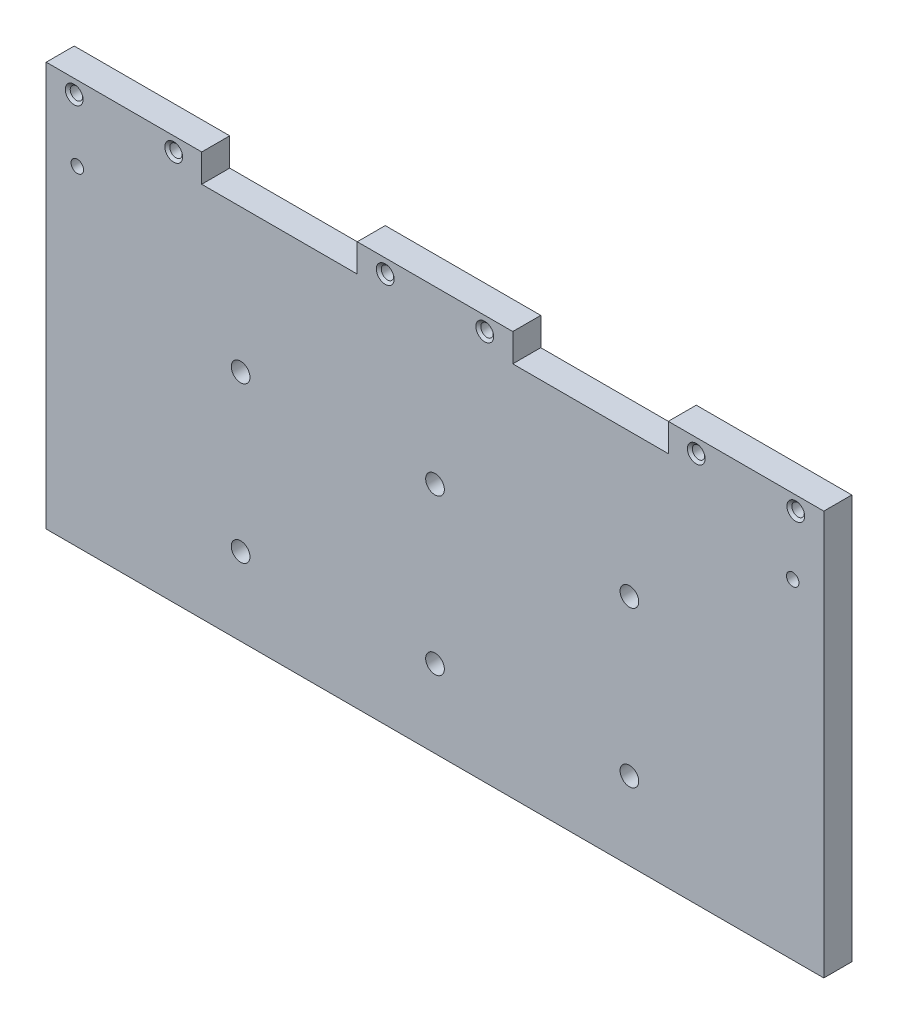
ISO-10303-21;
HEADER;
FILE_DESCRIPTION(('STEP AP214'),'2;1');
FILE_NAME('part.step','',(''),(''),'','','');
FILE_SCHEMA(('AUTOMOTIVE_DESIGN { 1 0 10303 214 1 1 1 1 }'));
ENDSEC;
DATA;
#1=APPLICATION_CONTEXT('core data for automotive mechanical design processes');
#2=APPLICATION_PROTOCOL_DEFINITION('international standard','automotive_design',2000,#1);
#3=PRODUCT_CONTEXT('',#1,'mechanical');
#4=PRODUCT('Part','Part','',(#3));
#5=PRODUCT_RELATED_PRODUCT_CATEGORY('part','',(#4));
#6=PRODUCT_DEFINITION_FORMATION('','',#4);
#7=PRODUCT_DEFINITION_CONTEXT('part definition',#1,'design');
#8=PRODUCT_DEFINITION('design','',#6,#7);
#9=PRODUCT_DEFINITION_SHAPE('','',#8);
#10=(LENGTH_UNIT() NAMED_UNIT(*) SI_UNIT(.MILLI.,.METRE.));
#11=(NAMED_UNIT(*) PLANE_ANGLE_UNIT() SI_UNIT($,.RADIAN.));
#12=(NAMED_UNIT(*) SI_UNIT($,.STERADIAN.) SOLID_ANGLE_UNIT());
#13=UNCERTAINTY_MEASURE_WITH_UNIT(LENGTH_MEASURE(1.E-05),#10,'distance_accuracy_value','');
#14=(GEOMETRIC_REPRESENTATION_CONTEXT(3) GLOBAL_UNCERTAINTY_ASSIGNED_CONTEXT((#13)) GLOBAL_UNIT_ASSIGNED_CONTEXT((#10,
#11,#12)) REPRESENTATION_CONTEXT('',''));
#15=CARTESIAN_POINT('',(0.,0.,0.));
#16=DIRECTION('',(0.,0.,1.));
#17=DIRECTION('',(1.,0.,0.));
#18=AXIS2_PLACEMENT_3D('',#15,#16,#17);
#19=CARTESIAN_POINT('',(-49.0030507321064,68.9522655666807,9.));
#20=DIRECTION('',(1.,0.,0.));
#21=DIRECTION('',(0.,1.,0.));
#22=AXIS2_PLACEMENT_3D('',#19,#20,#21);
#23=PLANE('',#22);
#24=DIRECTION('',(0.,-1.,0.));
#25=VECTOR('',#24,1.);
#26=CARTESIAN_POINT('',(-49.0030507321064,68.9522655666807,0.));
#27=LINE('',#26,#25);
#28=CARTESIAN_POINT('',(-49.0030507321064,68.9522655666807,0.));
#29=VERTEX_POINT('',#28);
#30=CARTESIAN_POINT('',(-49.0030507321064,-61.0477344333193,0.));
#31=VERTEX_POINT('',#30);
#32=EDGE_CURVE('E157',#29,#31,#27,.T.);
#33=ORIENTED_EDGE('',*,*,#32,.T.);
#34=DIRECTION('',(0.,0.,-1.));
#35=VECTOR('',#34,1.);
#36=CARTESIAN_POINT('',(-49.0030507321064,-61.0477344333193,9.));
#37=LINE('',#36,#35);
#38=CARTESIAN_POINT('',(-49.0030507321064,-61.0477344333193,9.));
#39=VERTEX_POINT('',#38);
#40=EDGE_CURVE('E11',#39,#31,#37,.T.);
#41=ORIENTED_EDGE('',*,*,#40,.F.);
#42=DIRECTION('',(0.,-1.,0.));
#43=VECTOR('',#42,1.);
#44=CARTESIAN_POINT('',(-49.0030507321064,68.9522655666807,9.));
#45=LINE('',#44,#43);
#46=CARTESIAN_POINT('',(-49.0030507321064,68.9522655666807,9.));
#47=VERTEX_POINT('',#46);
#48=EDGE_CURVE('E180',#47,#39,#45,.T.);
#49=ORIENTED_EDGE('',*,*,#48,.F.);
#50=DIRECTION('',(0.,0.,-1.));
#51=VECTOR('',#50,1.);
#52=CARTESIAN_POINT('',(-49.0030507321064,68.9522655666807,9.));
#53=LINE('',#52,#51);
#54=EDGE_CURVE('E153',#47,#29,#53,.T.);
#55=ORIENTED_EDGE('',*,*,#54,.T.);
#56=EDGE_LOOP('',(#33,#41,#49,#55));
#57=FACE_BOUND('',#56,.T.);
#58=ADVANCED_FACE('F35',(#57),#23,.F.);
#59=CARTESIAN_POINT('',(-49.0030507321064,-61.0477344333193,9.));
#60=DIRECTION('',(0.,1.,0.));
#61=DIRECTION('',(0.,0.,1.));
#62=AXIS2_PLACEMENT_3D('',#59,#60,#61);
#63=PLANE('',#62);
#64=DIRECTION('',(1.,0.,0.));
#65=VECTOR('',#64,1.);
#66=CARTESIAN_POINT('',(-49.0030507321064,-61.0477344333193,0.));
#67=LINE('',#66,#65);
#68=CARTESIAN_POINT('',(200.996949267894,-61.0477344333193,0.));
#69=VERTEX_POINT('',#68);
#70=EDGE_CURVE('E160',#31,#69,#67,.T.);
#71=ORIENTED_EDGE('',*,*,#70,.T.);
#72=DIRECTION('',(0.,0.,-1.));
#73=VECTOR('',#72,1.);
#74=CARTESIAN_POINT('',(200.996949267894,-61.0477344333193,9.));
#75=LINE('',#74,#73);
#76=CARTESIAN_POINT('',(200.996949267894,-61.0477344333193,9.));
#77=VERTEX_POINT('',#76);
#78=EDGE_CURVE('E44',#77,#69,#75,.T.);
#79=ORIENTED_EDGE('',*,*,#78,.F.);
#80=DIRECTION('',(1.,0.,0.));
#81=VECTOR('',#80,1.);
#82=CARTESIAN_POINT('',(-49.0030507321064,-61.0477344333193,9.));
#83=LINE('',#82,#81);
#84=EDGE_CURVE('E108',#39,#77,#83,.T.);
#85=ORIENTED_EDGE('',*,*,#84,.F.);
#86=ORIENTED_EDGE('',*,*,#40,.T.);
#87=EDGE_LOOP('',(#71,#79,#85,#86));
#88=FACE_BOUND('',#87,.T.);
#89=ADVANCED_FACE('F301',(#88),#63,.F.);
#90=CARTESIAN_POINT('',(200.996949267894,68.9522655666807,9.));
#91=DIRECTION('',(-1.,0.,0.));
#92=DIRECTION('',(0.,-1.,0.));
#93=AXIS2_PLACEMENT_3D('',#90,#91,#92);
#94=PLANE('',#93);
#95=DIRECTION('',(0.,1.,0.));
#96=VECTOR('',#95,1.);
#97=CARTESIAN_POINT('',(200.996949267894,68.9522655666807,0.));
#98=LINE('',#97,#96);
#99=CARTESIAN_POINT('',(200.996949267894,68.9522655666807,0.));
#100=VERTEX_POINT('',#99);
#101=EDGE_CURVE('E163',#69,#100,#98,.T.);
#102=ORIENTED_EDGE('',*,*,#101,.T.);
#103=DIRECTION('',(0.,0.,-1.));
#104=VECTOR('',#103,1.);
#105=CARTESIAN_POINT('',(200.996949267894,68.9522655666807,9.));
#106=LINE('',#105,#104);
#107=CARTESIAN_POINT('',(200.996949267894,68.9522655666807,9.));
#108=VERTEX_POINT('',#107);
#109=EDGE_CURVE('E199',#108,#100,#106,.T.);
#110=ORIENTED_EDGE('',*,*,#109,.F.);
#111=DIRECTION('',(0.,1.,0.));
#112=VECTOR('',#111,1.);
#113=CARTESIAN_POINT('',(200.996949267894,68.9522655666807,9.));
#114=LINE('',#113,#112);
#115=EDGE_CURVE('E260',#77,#108,#114,.T.);
#116=ORIENTED_EDGE('',*,*,#115,.F.);
#117=ORIENTED_EDGE('',*,*,#78,.T.);
#118=EDGE_LOOP('',(#102,#110,#116,#117));
#119=FACE_BOUND('',#118,.T.);
#120=ADVANCED_FACE('F305',(#119),#94,.F.);
#121=CARTESIAN_POINT('',(150.996949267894,68.9522655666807,9.));
#122=DIRECTION('',(0.,-1.,0.));
#123=DIRECTION('',(0.,0.,-1.));
#124=AXIS2_PLACEMENT_3D('',#121,#122,#123);
#125=PLANE('',#124);
#126=DIRECTION('',(-1.,0.,0.));
#127=VECTOR('',#126,1.);
#128=CARTESIAN_POINT('',(150.996949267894,68.9522655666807,0.));
#129=LINE('',#128,#127);
#130=CARTESIAN_POINT('',(150.996949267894,68.9522655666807,0.));
#131=VERTEX_POINT('',#130);
#132=EDGE_CURVE('E165',#100,#131,#129,.T.);
#133=ORIENTED_EDGE('',*,*,#132,.T.);
#134=DIRECTION('',(0.,0.,-1.));
#135=VECTOR('',#134,1.);
#136=CARTESIAN_POINT('',(150.996949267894,68.9522655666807,9.));
#137=LINE('',#136,#135);
#138=CARTESIAN_POINT('',(150.996949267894,68.9522655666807,9.));
#139=VERTEX_POINT('',#138);
#140=EDGE_CURVE('E196',#139,#131,#137,.T.);
#141=ORIENTED_EDGE('',*,*,#140,.F.);
#142=DIRECTION('',(-1.,0.,0.));
#143=VECTOR('',#142,1.);
#144=CARTESIAN_POINT('',(150.996949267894,68.9522655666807,9.));
#145=LINE('',#144,#143);
#146=EDGE_CURVE('E262',#108,#139,#145,.T.);
#147=ORIENTED_EDGE('',*,*,#146,.F.);
#148=ORIENTED_EDGE('',*,*,#109,.T.);
#149=EDGE_LOOP('',(#133,#141,#147,#148));
#150=FACE_BOUND('',#149,.T.);
#151=ADVANCED_FACE('F309',(#150),#125,.F.);
#152=CARTESIAN_POINT('',(150.996949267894,59.9522655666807,9.));
#153=DIRECTION('',(1.,0.,0.));
#154=DIRECTION('',(0.,0.,-1.));
#155=AXIS2_PLACEMENT_3D('',#152,#153,#154);
#156=PLANE('',#155);
#157=DIRECTION('',(0.,-1.,0.));
#158=VECTOR('',#157,1.);
#159=CARTESIAN_POINT('',(150.996949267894,59.9522655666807,0.));
#160=LINE('',#159,#158);
#161=CARTESIAN_POINT('',(150.996949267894,59.9522655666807,0.));
#162=VERTEX_POINT('',#161);
#163=EDGE_CURVE('E167',#131,#162,#160,.T.);
#164=ORIENTED_EDGE('',*,*,#163,.T.);
#165=DIRECTION('',(0.,0.,-1.));
#166=VECTOR('',#165,1.);
#167=CARTESIAN_POINT('',(150.996949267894,59.9522655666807,9.));
#168=LINE('',#167,#166);
#169=CARTESIAN_POINT('',(150.996949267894,59.9522655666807,9.));
#170=VERTEX_POINT('',#169);
#171=EDGE_CURVE('E193',#170,#162,#168,.T.);
#172=ORIENTED_EDGE('',*,*,#171,.F.);
#173=DIRECTION('',(0.,-1.,0.));
#174=VECTOR('',#173,1.);
#175=CARTESIAN_POINT('',(150.996949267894,59.9522655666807,9.));
#176=LINE('',#175,#174);
#177=EDGE_CURVE('E264',#139,#170,#176,.T.);
#178=ORIENTED_EDGE('',*,*,#177,.F.);
#179=ORIENTED_EDGE('',*,*,#140,.T.);
#180=EDGE_LOOP('',(#164,#172,#178,#179));
#181=FACE_BOUND('',#180,.T.);
#182=ADVANCED_FACE('F315',(#181),#156,.F.);
#183=CARTESIAN_POINT('',(100.996949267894,59.9522655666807,9.));
#184=DIRECTION('',(0.,-1.,0.));
#185=DIRECTION('',(0.,0.,-1.));
#186=AXIS2_PLACEMENT_3D('',#183,#184,#185);
#187=PLANE('',#186);
#188=DIRECTION('',(-1.,0.,0.));
#189=VECTOR('',#188,1.);
#190=CARTESIAN_POINT('',(100.996949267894,59.9522655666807,0.));
#191=LINE('',#190,#189);
#192=CARTESIAN_POINT('',(100.996949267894,59.9522655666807,0.));
#193=VERTEX_POINT('',#192);
#194=EDGE_CURVE('E169',#162,#193,#191,.T.);
#195=ORIENTED_EDGE('',*,*,#194,.T.);
#196=DIRECTION('',(0.,0.,-1.));
#197=VECTOR('',#196,1.);
#198=CARTESIAN_POINT('',(100.996949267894,59.9522655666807,9.));
#199=LINE('',#198,#197);
#200=CARTESIAN_POINT('',(100.996949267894,59.9522655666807,9.));
#201=VERTEX_POINT('',#200);
#202=EDGE_CURVE('E190',#201,#193,#199,.T.);
#203=ORIENTED_EDGE('',*,*,#202,.F.);
#204=DIRECTION('',(-1.,0.,0.));
#205=VECTOR('',#204,1.);
#206=CARTESIAN_POINT('',(100.996949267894,59.9522655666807,9.));
#207=LINE('',#206,#205);
#208=EDGE_CURVE('E266',#170,#201,#207,.T.);
#209=ORIENTED_EDGE('',*,*,#208,.F.);
#210=ORIENTED_EDGE('',*,*,#171,.T.);
#211=EDGE_LOOP('',(#195,#203,#209,#210));
#212=FACE_BOUND('',#211,.T.);
#213=ADVANCED_FACE('F319',(#212),#187,.F.);
#214=CARTESIAN_POINT('',(100.996949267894,68.9522655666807,9.));
#215=DIRECTION('',(-1.,0.,0.));
#216=DIRECTION('',(0.,0.,1.));
#217=AXIS2_PLACEMENT_3D('',#214,#215,#216);
#218=PLANE('',#217);
#219=DIRECTION('',(0.,1.,0.));
#220=VECTOR('',#219,1.);
#221=CARTESIAN_POINT('',(100.996949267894,68.9522655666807,0.));
#222=LINE('',#221,#220);
#223=CARTESIAN_POINT('',(100.996949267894,68.9522655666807,0.));
#224=VERTEX_POINT('',#223);
#225=EDGE_CURVE('E171',#193,#224,#222,.T.);
#226=ORIENTED_EDGE('',*,*,#225,.T.);
#227=DIRECTION('',(0.,0.,-1.));
#228=VECTOR('',#227,1.);
#229=CARTESIAN_POINT('',(100.996949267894,68.9522655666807,9.));
#230=LINE('',#229,#228);
#231=CARTESIAN_POINT('',(100.996949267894,68.9522655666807,9.));
#232=VERTEX_POINT('',#231);
#233=EDGE_CURVE('E187',#232,#224,#230,.T.);
#234=ORIENTED_EDGE('',*,*,#233,.F.);
#235=DIRECTION('',(0.,1.,0.));
#236=VECTOR('',#235,1.);
#237=CARTESIAN_POINT('',(100.996949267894,68.9522655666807,9.));
#238=LINE('',#237,#236);
#239=EDGE_CURVE('E268',#201,#232,#238,.T.);
#240=ORIENTED_EDGE('',*,*,#239,.F.);
#241=ORIENTED_EDGE('',*,*,#202,.T.);
#242=EDGE_LOOP('',(#226,#234,#240,#241));
#243=FACE_BOUND('',#242,.T.);
#244=ADVANCED_FACE('F323',(#243),#218,.F.);
#245=CARTESIAN_POINT('',(50.9969492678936,68.9522655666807,9.));
#246=DIRECTION('',(0.,-1.,0.));
#247=DIRECTION('',(0.,0.,-1.));
#248=AXIS2_PLACEMENT_3D('',#245,#246,#247);
#249=PLANE('',#248);
#250=DIRECTION('',(-1.,0.,0.));
#251=VECTOR('',#250,1.);
#252=CARTESIAN_POINT('',(50.9969492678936,68.9522655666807,0.));
#253=LINE('',#252,#251);
#254=CARTESIAN_POINT('',(50.9969492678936,68.9522655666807,0.));
#255=VERTEX_POINT('',#254);
#256=EDGE_CURVE('E173',#224,#255,#253,.T.);
#257=ORIENTED_EDGE('',*,*,#256,.T.);
#258=DIRECTION('',(0.,0.,-1.));
#259=VECTOR('',#258,1.);
#260=CARTESIAN_POINT('',(50.9969492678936,68.9522655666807,9.));
#261=LINE('',#260,#259);
#262=CARTESIAN_POINT('',(50.9969492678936,68.9522655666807,9.));
#263=VERTEX_POINT('',#262);
#264=EDGE_CURVE('E184',#263,#255,#261,.T.);
#265=ORIENTED_EDGE('',*,*,#264,.F.);
#266=DIRECTION('',(-1.,0.,0.));
#267=VECTOR('',#266,1.);
#268=CARTESIAN_POINT('',(50.9969492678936,68.9522655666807,9.));
#269=LINE('',#268,#267);
#270=EDGE_CURVE('E270',#232,#263,#269,.T.);
#271=ORIENTED_EDGE('',*,*,#270,.F.);
#272=ORIENTED_EDGE('',*,*,#233,.T.);
#273=EDGE_LOOP('',(#257,#265,#271,#272));
#274=FACE_BOUND('',#273,.T.);
#275=ADVANCED_FACE('F276',(#274),#249,.F.);
#276=CARTESIAN_POINT('',(50.9969492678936,59.9522655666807,9.));
#277=DIRECTION('',(1.,0.,0.));
#278=DIRECTION('',(0.,0.,-1.));
#279=AXIS2_PLACEMENT_3D('',#276,#277,#278);
#280=PLANE('',#279);
#281=DIRECTION('',(0.,-1.,0.));
#282=VECTOR('',#281,1.);
#283=CARTESIAN_POINT('',(50.9969492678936,59.9522655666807,0.));
#284=LINE('',#283,#282);
#285=CARTESIAN_POINT('',(50.9969492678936,59.9522655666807,0.));
#286=VERTEX_POINT('',#285);
#287=EDGE_CURVE('E175',#255,#286,#284,.T.);
#288=ORIENTED_EDGE('',*,*,#287,.T.);
#289=DIRECTION('',(0.,0.,-1.));
#290=VECTOR('',#289,1.);
#291=CARTESIAN_POINT('',(50.9969492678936,59.9522655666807,9.));
#292=LINE('',#291,#290);
#293=CARTESIAN_POINT('',(50.9969492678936,59.9522655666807,9.));
#294=VERTEX_POINT('',#293);
#295=EDGE_CURVE('E148',#294,#286,#292,.T.);
#296=ORIENTED_EDGE('',*,*,#295,.F.);
#297=DIRECTION('',(0.,-1.,0.));
#298=VECTOR('',#297,1.);
#299=CARTESIAN_POINT('',(50.9969492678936,59.9522655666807,9.));
#300=LINE('',#299,#298);
#301=EDGE_CURVE('E139',#263,#294,#300,.T.);
#302=ORIENTED_EDGE('',*,*,#301,.F.);
#303=ORIENTED_EDGE('',*,*,#264,.T.);
#304=EDGE_LOOP('',(#288,#296,#302,#303));
#305=FACE_BOUND('',#304,.T.);
#306=ADVANCED_FACE('F280',(#305),#280,.F.);
#307=CARTESIAN_POINT('',(0.996949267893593,59.9522655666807,9.));
#308=DIRECTION('',(0.,-1.,0.));
#309=DIRECTION('',(0.,0.,-1.));
#310=AXIS2_PLACEMENT_3D('',#307,#308,#309);
#311=PLANE('',#310);
#312=DIRECTION('',(-1.,0.,0.));
#313=VECTOR('',#312,1.);
#314=CARTESIAN_POINT('',(0.996949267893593,59.9522655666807,0.));
#315=LINE('',#314,#313);
#316=CARTESIAN_POINT('',(0.996949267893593,59.9522655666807,0.));
#317=VERTEX_POINT('',#316);
#318=EDGE_CURVE('E147',#286,#317,#315,.T.);
#319=ORIENTED_EDGE('',*,*,#318,.T.);
#320=DIRECTION('',(0.,0.,-1.));
#321=VECTOR('',#320,1.);
#322=CARTESIAN_POINT('',(0.996949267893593,59.9522655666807,9.));
#323=LINE('',#322,#321);
#324=CARTESIAN_POINT('',(0.996949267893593,59.9522655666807,9.));
#325=VERTEX_POINT('',#324);
#326=EDGE_CURVE('E144',#325,#317,#323,.T.);
#327=ORIENTED_EDGE('',*,*,#326,.F.);
#328=DIRECTION('',(-1.,0.,0.));
#329=VECTOR('',#328,1.);
#330=CARTESIAN_POINT('',(0.996949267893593,59.9522655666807,9.));
#331=LINE('',#330,#329);
#332=EDGE_CURVE('E133',#294,#325,#331,.T.);
#333=ORIENTED_EDGE('',*,*,#332,.F.);
#334=ORIENTED_EDGE('',*,*,#295,.T.);
#335=EDGE_LOOP('',(#319,#327,#333,#334));
#336=FACE_BOUND('',#335,.T.);
#337=ADVANCED_FACE('F145',(#336),#311,.F.);
#338=CARTESIAN_POINT('',(0.996949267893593,68.9522655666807,9.));
#339=DIRECTION('',(-1.,0.,0.));
#340=DIRECTION('',(0.,0.,1.));
#341=AXIS2_PLACEMENT_3D('',#338,#339,#340);
#342=PLANE('',#341);
#343=DIRECTION('',(0.,1.,0.));
#344=VECTOR('',#343,1.);
#345=CARTESIAN_POINT('',(0.996949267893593,68.9522655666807,0.));
#346=LINE('',#345,#344);
#347=CARTESIAN_POINT('',(0.996949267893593,68.9522655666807,0.));
#348=VERTEX_POINT('',#347);
#349=EDGE_CURVE('E94',#317,#348,#346,.T.);
#350=ORIENTED_EDGE('',*,*,#349,.T.);
#351=DIRECTION('',(0.,0.,-1.));
#352=VECTOR('',#351,1.);
#353=CARTESIAN_POINT('',(0.996949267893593,68.9522655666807,9.));
#354=LINE('',#353,#352);
#355=CARTESIAN_POINT('',(0.996949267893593,68.9522655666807,9.));
#356=VERTEX_POINT('',#355);
#357=EDGE_CURVE('E149',#356,#348,#354,.T.);
#358=ORIENTED_EDGE('',*,*,#357,.F.);
#359=DIRECTION('',(0.,1.,0.));
#360=VECTOR('',#359,1.);
#361=CARTESIAN_POINT('',(0.996949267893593,68.9522655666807,9.));
#362=LINE('',#361,#360);
#363=EDGE_CURVE('E137',#325,#356,#362,.T.);
#364=ORIENTED_EDGE('',*,*,#363,.F.);
#365=ORIENTED_EDGE('',*,*,#326,.T.);
#366=EDGE_LOOP('',(#350,#358,#364,#365));
#367=FACE_BOUND('',#366,.T.);
#368=ADVANCED_FACE('F151',(#367),#342,.F.);
#369=CARTESIAN_POINT('',(-49.0030507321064,68.9522655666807,9.));
#370=DIRECTION('',(0.,-1.,0.));
#371=DIRECTION('',(0.,0.,-1.));
#372=AXIS2_PLACEMENT_3D('',#369,#370,#371);
#373=PLANE('',#372);
#374=DIRECTION('',(-1.,0.,0.));
#375=VECTOR('',#374,1.);
#376=CARTESIAN_POINT('',(-49.0030507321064,68.9522655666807,0.));
#377=LINE('',#376,#375);
#378=EDGE_CURVE('E100',#348,#29,#377,.T.);
#379=ORIENTED_EDGE('',*,*,#378,.T.);
#380=ORIENTED_EDGE('',*,*,#54,.F.);
#381=DIRECTION('',(-1.,0.,0.));
#382=VECTOR('',#381,1.);
#383=CARTESIAN_POINT('',(-49.0030507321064,68.9522655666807,9.));
#384=LINE('',#383,#382);
#385=EDGE_CURVE('E53',#356,#47,#384,.T.);
#386=ORIENTED_EDGE('',*,*,#385,.F.);
#387=ORIENTED_EDGE('',*,*,#357,.T.);
#388=EDGE_LOOP('',(#379,#380,#386,#387));
#389=FACE_BOUND('',#388,.T.);
#390=ADVANCED_FACE('F288',(#389),#373,.F.);
#391=CARTESIAN_POINT('',(0.,0.,9.));
#392=DIRECTION('',(0.,0.,1.));
#393=DIRECTION('',(1.,0.,0.));
#394=AXIS2_PLACEMENT_3D('',#391,#392,#393);
#395=PLANE('',#394);
#396=CARTESIAN_POINT('',(75.9969492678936,-36.0477344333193,9.));
#397=DIRECTION('',(0.,0.,1.));
#398=DIRECTION('',(1.,0.,0.));
#399=AXIS2_PLACEMENT_3D('',#396,#397,#398);
#400=CIRCLE('',#399,3.00000000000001);
#401=CARTESIAN_POINT('',(78.9969492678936,-36.0477344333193,9.));
#402=VERTEX_POINT('',#401);
#403=EDGE_CURVE('E559',#402,#402,#400,.T.);
#404=ORIENTED_EDGE('',*,*,#403,.F.);
#405=EDGE_LOOP('',(#404));
#406=FACE_BOUND('',#405,.T.);
#407=CARTESIAN_POINT('',(75.9969492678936,13.9522655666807,9.));
#408=DIRECTION('',(0.,0.,1.));
#409=DIRECTION('',(1.,0.,0.));
#410=AXIS2_PLACEMENT_3D('',#407,#408,#409);
#411=CIRCLE('',#410,3.00000000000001);
#412=CARTESIAN_POINT('',(78.9969492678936,13.9522655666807,9.));
#413=VERTEX_POINT('',#412);
#414=EDGE_CURVE('E585',#413,#413,#411,.T.);
#415=ORIENTED_EDGE('',*,*,#414,.F.);
#416=EDGE_LOOP('',(#415));
#417=FACE_BOUND('',#416,.T.);
#418=CARTESIAN_POINT('',(13.4969492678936,-36.0477344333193,9.));
#419=DIRECTION('',(0.,0.,1.));
#420=DIRECTION('',(1.,0.,0.));
#421=AXIS2_PLACEMENT_3D('',#418,#419,#420);
#422=CIRCLE('',#421,2.99999999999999);
#423=CARTESIAN_POINT('',(16.4969492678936,-36.0477344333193,9.));
#424=VERTEX_POINT('',#423);
#425=EDGE_CURVE('E582',#424,#424,#422,.T.);
#426=ORIENTED_EDGE('',*,*,#425,.F.);
#427=EDGE_LOOP('',(#426));
#428=FACE_BOUND('',#427,.T.);
#429=CARTESIAN_POINT('',(13.4969492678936,13.9522655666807,9.));
#430=DIRECTION('',(0.,0.,1.));
#431=DIRECTION('',(1.,0.,0.));
#432=AXIS2_PLACEMENT_3D('',#429,#430,#431);
#433=CIRCLE('',#432,2.99999999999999);
#434=CARTESIAN_POINT('',(16.4969492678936,13.9522655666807,9.));
#435=VERTEX_POINT('',#434);
#436=EDGE_CURVE('E579',#435,#435,#433,.T.);
#437=ORIENTED_EDGE('',*,*,#436,.F.);
#438=EDGE_LOOP('',(#437));
#439=FACE_BOUND('',#438,.T.);
#440=CARTESIAN_POINT('',(138.496949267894,-36.0477344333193,9.));
#441=DIRECTION('',(0.,0.,1.));
#442=DIRECTION('',(1.,0.,0.));
#443=AXIS2_PLACEMENT_3D('',#440,#441,#442);
#444=CIRCLE('',#443,2.99999999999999);
#445=CARTESIAN_POINT('',(141.496949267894,-36.0477344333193,9.));
#446=VERTEX_POINT('',#445);
#447=EDGE_CURVE('E575',#446,#446,#444,.T.);
#448=ORIENTED_EDGE('',*,*,#447,.F.);
#449=EDGE_LOOP('',(#448));
#450=FACE_BOUND('',#449,.T.);
#451=CARTESIAN_POINT('',(138.496949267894,13.9522655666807,9.));
#452=DIRECTION('',(0.,0.,1.));
#453=DIRECTION('',(1.,0.,0.));
#454=AXIS2_PLACEMENT_3D('',#451,#452,#453);
#455=CIRCLE('',#454,2.99999999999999);
#456=CARTESIAN_POINT('',(141.496949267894,13.9522655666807,9.));
#457=VERTEX_POINT('',#456);
#458=EDGE_CURVE('E592',#457,#457,#455,.T.);
#459=ORIENTED_EDGE('',*,*,#458,.F.);
#460=EDGE_LOOP('',(#459));
#461=FACE_BOUND('',#460,.T.);
#462=CARTESIAN_POINT('',(-39.0030507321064,44.9522655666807,9.));
#463=DIRECTION('',(0.,0.,1.));
#464=DIRECTION('',(1.,0.,0.));
#465=AXIS2_PLACEMENT_3D('',#462,#463,#464);
#466=CIRCLE('',#465,2.);
#467=CARTESIAN_POINT('',(-37.0030507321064,44.9522655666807,9.));
#468=VERTEX_POINT('',#467);
#469=EDGE_CURVE('E598',#468,#468,#466,.T.);
#470=ORIENTED_EDGE('',*,*,#469,.F.);
#471=EDGE_LOOP('',(#470));
#472=FACE_BOUND('',#471,.T.);
#473=CARTESIAN_POINT('',(190.996949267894,44.9522655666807,9.));
#474=DIRECTION('',(0.,0.,1.));
#475=DIRECTION('',(1.,0.,0.));
#476=AXIS2_PLACEMENT_3D('',#473,#474,#475);
#477=CIRCLE('',#476,1.99999999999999);
#478=CARTESIAN_POINT('',(192.996949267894,44.9522655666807,9.));
#479=VERTEX_POINT('',#478);
#480=EDGE_CURVE('E603',#479,#479,#477,.T.);
#481=ORIENTED_EDGE('',*,*,#480,.F.);
#482=EDGE_LOOP('',(#481));
#483=FACE_BOUND('',#482,.T.);
#484=CARTESIAN_POINT('',(-40.0030507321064,64.4522655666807,9.));
#485=DIRECTION('',(0.,0.,1.));
#486=DIRECTION('',(1.,0.,0.));
#487=AXIS2_PLACEMENT_3D('',#484,#485,#486);
#488=CIRCLE('',#487,2.8575);
#489=CARTESIAN_POINT('',(-37.1455507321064,64.4522655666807,9.));
#490=VERTEX_POINT('',#489);
#491=EDGE_CURVE('E232',#490,#490,#488,.T.);
#492=ORIENTED_EDGE('',*,*,#491,.F.);
#493=EDGE_LOOP('',(#492));
#494=FACE_BOUND('',#493,.T.);
#495=CARTESIAN_POINT('',(-8.00305073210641,64.4522655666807,9.));
#496=DIRECTION('',(0.,0.,1.));
#497=DIRECTION('',(1.,0.,0.));
#498=AXIS2_PLACEMENT_3D('',#495,#496,#497);
#499=CIRCLE('',#498,2.8575);
#500=CARTESIAN_POINT('',(-5.14555073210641,64.4522655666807,9.));
#501=VERTEX_POINT('',#500);
#502=EDGE_CURVE('E222',#501,#501,#499,.T.);
#503=ORIENTED_EDGE('',*,*,#502,.F.);
#504=EDGE_LOOP('',(#503));
#505=FACE_BOUND('',#504,.T.);
#506=CARTESIAN_POINT('',(59.9969492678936,64.4522655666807,9.));
#507=DIRECTION('',(0.,0.,1.));
#508=DIRECTION('',(1.,0.,0.));
#509=AXIS2_PLACEMENT_3D('',#506,#507,#508);
#510=CIRCLE('',#509,2.8575);
#511=CARTESIAN_POINT('',(62.8544492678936,64.4522655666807,9.));
#512=VERTEX_POINT('',#511);
#513=EDGE_CURVE('E219',#512,#512,#510,.T.);
#514=ORIENTED_EDGE('',*,*,#513,.F.);
#515=EDGE_LOOP('',(#514));
#516=FACE_BOUND('',#515,.T.);
#517=CARTESIAN_POINT('',(91.9969492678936,64.4522655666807,9.));
#518=DIRECTION('',(0.,0.,1.));
#519=DIRECTION('',(1.,0.,0.));
#520=AXIS2_PLACEMENT_3D('',#517,#518,#519);
#521=CIRCLE('',#520,2.8575);
#522=CARTESIAN_POINT('',(94.8544492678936,64.4522655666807,9.));
#523=VERTEX_POINT('',#522);
#524=EDGE_CURVE('E216',#523,#523,#521,.T.);
#525=ORIENTED_EDGE('',*,*,#524,.F.);
#526=EDGE_LOOP('',(#525));
#527=FACE_BOUND('',#526,.T.);
#528=CARTESIAN_POINT('',(191.996949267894,64.4522655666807,9.));
#529=DIRECTION('',(0.,0.,1.));
#530=DIRECTION('',(1.,0.,0.));
#531=AXIS2_PLACEMENT_3D('',#528,#529,#530);
#532=CIRCLE('',#531,2.85750000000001);
#533=CARTESIAN_POINT('',(194.854449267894,64.4522655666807,9.));
#534=VERTEX_POINT('',#533);
#535=EDGE_CURVE('E212',#534,#534,#532,.T.);
#536=ORIENTED_EDGE('',*,*,#535,.F.);
#537=EDGE_LOOP('',(#536));
#538=FACE_BOUND('',#537,.T.);
#539=CARTESIAN_POINT('',(159.996949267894,64.4522655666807,9.));
#540=DIRECTION('',(0.,0.,1.));
#541=DIRECTION('',(1.,0.,0.));
#542=AXIS2_PLACEMENT_3D('',#539,#540,#541);
#543=CIRCLE('',#542,2.85749999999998);
#544=CARTESIAN_POINT('',(162.854449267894,64.4522655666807,9.));
#545=VERTEX_POINT('',#544);
#546=EDGE_CURVE('E208',#545,#545,#543,.T.);
#547=ORIENTED_EDGE('',*,*,#546,.F.);
#548=EDGE_LOOP('',(#547));
#549=FACE_BOUND('',#548,.T.);
#550=ORIENTED_EDGE('',*,*,#48,.T.);
#551=ORIENTED_EDGE('',*,*,#84,.T.);
#552=ORIENTED_EDGE('',*,*,#115,.T.);
#553=ORIENTED_EDGE('',*,*,#146,.T.);
#554=ORIENTED_EDGE('',*,*,#177,.T.);
#555=ORIENTED_EDGE('',*,*,#208,.T.);
#556=ORIENTED_EDGE('',*,*,#239,.T.);
#557=ORIENTED_EDGE('',*,*,#270,.T.);
#558=ORIENTED_EDGE('',*,*,#301,.T.);
#559=ORIENTED_EDGE('',*,*,#332,.T.);
#560=ORIENTED_EDGE('',*,*,#363,.T.);
#561=ORIENTED_EDGE('',*,*,#385,.T.);
#562=EDGE_LOOP('',(#550,#551,#552,#553,#554,#555,#556,#557,#558,#559,#560,#561));
#563=FACE_BOUND('',#562,.T.);
#564=ADVANCED_FACE('F135',(#406,#417,#428,#439,#450,#461,#472,#483,#494,#505,#516,#527,#538,
#549,#563),#395,.T.);
#565=CARTESIAN_POINT('',(0.,0.,0.));
#566=DIRECTION('',(0.,0.,1.));
#567=DIRECTION('',(1.,0.,0.));
#568=AXIS2_PLACEMENT_3D('',#565,#566,#567);
#569=PLANE('',#568);
#570=CARTESIAN_POINT('',(75.9969492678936,-36.0477344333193,0.));
#571=DIRECTION('',(0.,0.,-1.));
#572=DIRECTION('',(-1.,0.,0.));
#573=AXIS2_PLACEMENT_3D('',#570,#571,#572);
#574=CIRCLE('',#573,3.00000000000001);
#575=CARTESIAN_POINT('',(72.9969492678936,-36.0477344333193,0.));
#576=VERTEX_POINT('',#575);
#577=EDGE_CURVE('E562',#576,#576,#574,.T.);
#578=ORIENTED_EDGE('',*,*,#577,.F.);
#579=EDGE_LOOP('',(#578));
#580=FACE_BOUND('',#579,.T.);
#581=CARTESIAN_POINT('',(75.9969492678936,13.9522655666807,0.));
#582=DIRECTION('',(0.,0.,-1.));
#583=DIRECTION('',(-1.,0.,0.));
#584=AXIS2_PLACEMENT_3D('',#581,#582,#583);
#585=CIRCLE('',#584,3.00000000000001);
#586=CARTESIAN_POINT('',(72.9969492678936,13.9522655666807,0.));
#587=VERTEX_POINT('',#586);
#588=EDGE_CURVE('E564',#587,#587,#585,.T.);
#589=ORIENTED_EDGE('',*,*,#588,.F.);
#590=EDGE_LOOP('',(#589));
#591=FACE_BOUND('',#590,.T.);
#592=CARTESIAN_POINT('',(13.4969492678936,-36.0477344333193,0.));
#593=DIRECTION('',(0.,0.,-1.));
#594=DIRECTION('',(1.,0.,0.));
#595=AXIS2_PLACEMENT_3D('',#592,#593,#594);
#596=CIRCLE('',#595,2.99999999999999);
#597=CARTESIAN_POINT('',(16.4969492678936,-36.0477344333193,0.));
#598=VERTEX_POINT('',#597);
#599=EDGE_CURVE('E570',#598,#598,#596,.T.);
#600=ORIENTED_EDGE('',*,*,#599,.F.);
#601=EDGE_LOOP('',(#600));
#602=FACE_BOUND('',#601,.T.);
#603=CARTESIAN_POINT('',(13.4969492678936,13.9522655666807,0.));
#604=DIRECTION('',(0.,0.,-1.));
#605=DIRECTION('',(1.,0.,0.));
#606=AXIS2_PLACEMENT_3D('',#603,#604,#605);
#607=CIRCLE('',#606,2.99999999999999);
#608=CARTESIAN_POINT('',(16.4969492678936,13.9522655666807,0.));
#609=VERTEX_POINT('',#608);
#610=EDGE_CURVE('E563',#609,#609,#607,.T.);
#611=ORIENTED_EDGE('',*,*,#610,.F.);
#612=EDGE_LOOP('',(#611));
#613=FACE_BOUND('',#612,.T.);
#614=CARTESIAN_POINT('',(138.496949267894,-36.0477344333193,0.));
#615=DIRECTION('',(0.,0.,-1.));
#616=DIRECTION('',(-1.,0.,0.));
#617=AXIS2_PLACEMENT_3D('',#614,#615,#616);
#618=CIRCLE('',#617,2.99999999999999);
#619=CARTESIAN_POINT('',(135.496949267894,-36.0477344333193,0.));
#620=VERTEX_POINT('',#619);
#621=EDGE_CURVE('E567',#620,#620,#618,.T.);
#622=ORIENTED_EDGE('',*,*,#621,.F.);
#623=EDGE_LOOP('',(#622));
#624=FACE_BOUND('',#623,.T.);
#625=CARTESIAN_POINT('',(138.496949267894,13.9522655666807,0.));
#626=DIRECTION('',(0.,0.,-1.));
#627=DIRECTION('',(-1.,0.,0.));
#628=AXIS2_PLACEMENT_3D('',#625,#626,#627);
#629=CIRCLE('',#628,2.99999999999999);
#630=CARTESIAN_POINT('',(135.496949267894,13.9522655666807,0.));
#631=VERTEX_POINT('',#630);
#632=EDGE_CURVE('E589',#631,#631,#629,.T.);
#633=ORIENTED_EDGE('',*,*,#632,.F.);
#634=EDGE_LOOP('',(#633));
#635=FACE_BOUND('',#634,.T.);
#636=CARTESIAN_POINT('',(-39.0030507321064,44.9522655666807,0.));
#637=DIRECTION('',(0.,0.,-1.));
#638=DIRECTION('',(-1.,0.,0.));
#639=AXIS2_PLACEMENT_3D('',#636,#637,#638);
#640=CIRCLE('',#639,2.);
#641=CARTESIAN_POINT('',(-41.0030507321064,44.9522655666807,0.));
#642=VERTEX_POINT('',#641);
#643=EDGE_CURVE('E595',#642,#642,#640,.T.);
#644=ORIENTED_EDGE('',*,*,#643,.F.);
#645=EDGE_LOOP('',(#644));
#646=FACE_BOUND('',#645,.T.);
#647=CARTESIAN_POINT('',(190.996949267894,44.9522655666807,0.));
#648=DIRECTION('',(0.,0.,-1.));
#649=DIRECTION('',(-1.,0.,0.));
#650=AXIS2_PLACEMENT_3D('',#647,#648,#649);
#651=CIRCLE('',#650,1.99999999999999);
#652=CARTESIAN_POINT('',(188.996949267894,44.9522655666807,0.));
#653=VERTEX_POINT('',#652);
#654=EDGE_CURVE('E601',#653,#653,#651,.T.);
#655=ORIENTED_EDGE('',*,*,#654,.F.);
#656=EDGE_LOOP('',(#655));
#657=FACE_BOUND('',#656,.T.);
#658=CARTESIAN_POINT('',(-8.00305073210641,64.4522655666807,0.));
#659=DIRECTION('',(0.,0.,1.));
#660=DIRECTION('',(1.,0.,0.));
#661=AXIS2_PLACEMENT_3D('',#658,#659,#660);
#662=CIRCLE('',#661,2.);
#663=CARTESIAN_POINT('',(-6.00305073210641,64.4522655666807,0.));
#664=VERTEX_POINT('',#663);
#665=EDGE_CURVE('E242',#664,#664,#662,.T.);
#666=ORIENTED_EDGE('',*,*,#665,.T.);
#667=EDGE_LOOP('',(#666));
#668=FACE_BOUND('',#667,.T.);
#669=CARTESIAN_POINT('',(-40.0030507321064,64.4522655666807,0.));
#670=DIRECTION('',(0.,0.,1.));
#671=DIRECTION('',(1.,0.,0.));
#672=AXIS2_PLACEMENT_3D('',#669,#670,#671);
#673=CIRCLE('',#672,2.);
#674=CARTESIAN_POINT('',(-38.0030507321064,64.4522655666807,0.));
#675=VERTEX_POINT('',#674);
#676=EDGE_CURVE('E245',#675,#675,#673,.T.);
#677=ORIENTED_EDGE('',*,*,#676,.T.);
#678=EDGE_LOOP('',(#677));
#679=FACE_BOUND('',#678,.T.);
#680=CARTESIAN_POINT('',(91.9969492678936,64.4522655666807,0.));
#681=DIRECTION('',(0.,0.,1.));
#682=DIRECTION('',(-1.,0.,0.));
#683=AXIS2_PLACEMENT_3D('',#680,#681,#682);
#684=CIRCLE('',#683,2.00000000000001);
#685=CARTESIAN_POINT('',(89.9969492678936,64.4522655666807,0.));
#686=VERTEX_POINT('',#685);
#687=EDGE_CURVE('E248',#686,#686,#684,.T.);
#688=ORIENTED_EDGE('',*,*,#687,.T.);
#689=EDGE_LOOP('',(#688));
#690=FACE_BOUND('',#689,.T.);
#691=CARTESIAN_POINT('',(191.996949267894,64.4522655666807,0.));
#692=DIRECTION('',(0.,0.,1.));
#693=DIRECTION('',(-1.,0.,0.));
#694=AXIS2_PLACEMENT_3D('',#691,#692,#693);
#695=CIRCLE('',#694,2.);
#696=CARTESIAN_POINT('',(189.996949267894,64.4522655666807,0.));
#697=VERTEX_POINT('',#696);
#698=EDGE_CURVE('E251',#697,#697,#695,.T.);
#699=ORIENTED_EDGE('',*,*,#698,.T.);
#700=EDGE_LOOP('',(#699));
#701=FACE_BOUND('',#700,.T.);
#702=CARTESIAN_POINT('',(159.996949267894,64.4522655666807,0.));
#703=DIRECTION('',(0.,0.,1.));
#704=DIRECTION('',(-1.,0.,0.));
#705=AXIS2_PLACEMENT_3D('',#702,#703,#704);
#706=CIRCLE('',#705,2.00000000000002);
#707=CARTESIAN_POINT('',(157.996949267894,64.4522655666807,0.));
#708=VERTEX_POINT('',#707);
#709=EDGE_CURVE('E207',#708,#708,#706,.T.);
#710=ORIENTED_EDGE('',*,*,#709,.T.);
#711=EDGE_LOOP('',(#710));
#712=FACE_BOUND('',#711,.T.);
#713=CARTESIAN_POINT('',(59.9969492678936,64.4522655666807,0.));
#714=DIRECTION('',(0.,0.,1.));
#715=DIRECTION('',(1.,0.,0.));
#716=AXIS2_PLACEMENT_3D('',#713,#714,#715);
#717=CIRCLE('',#716,2.);
#718=CARTESIAN_POINT('',(61.9969492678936,64.4522655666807,0.));
#719=VERTEX_POINT('',#718);
#720=EDGE_CURVE('E161',#719,#719,#717,.T.);
#721=ORIENTED_EDGE('',*,*,#720,.T.);
#722=EDGE_LOOP('',(#721));
#723=FACE_BOUND('',#722,.T.);
#724=ORIENTED_EDGE('',*,*,#32,.F.);
#725=ORIENTED_EDGE('',*,*,#378,.F.);
#726=ORIENTED_EDGE('',*,*,#349,.F.);
#727=ORIENTED_EDGE('',*,*,#318,.F.);
#728=ORIENTED_EDGE('',*,*,#287,.F.);
#729=ORIENTED_EDGE('',*,*,#256,.F.);
#730=ORIENTED_EDGE('',*,*,#225,.F.);
#731=ORIENTED_EDGE('',*,*,#194,.F.);
#732=ORIENTED_EDGE('',*,*,#163,.F.);
#733=ORIENTED_EDGE('',*,*,#132,.F.);
#734=ORIENTED_EDGE('',*,*,#101,.F.);
#735=ORIENTED_EDGE('',*,*,#70,.F.);
#736=EDGE_LOOP('',(#724,#725,#726,#727,#728,#729,#730,#731,#732,#733,#734,#735));
#737=FACE_BOUND('',#736,.T.);
#738=ADVANCED_FACE('F283',(#580,#591,#602,#613,#624,#635,#646,#657,#668,#679,#690,#701,#712,
#723,#737),#569,.F.);
#739=CARTESIAN_POINT('',(59.9969492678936,64.4522655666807,0.));
#740=DIRECTION('',(0.,0.,1.));
#741=DIRECTION('',(1.,0.,0.));
#742=AXIS2_PLACEMENT_3D('',#739,#740,#741);
#743=CYLINDRICAL_SURFACE('',#742,2.);
#744=CARTESIAN_POINT('',(59.9969492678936,64.4522655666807,8.28047206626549));
#745=DIRECTION('',(0.,0.,1.));
#746=DIRECTION('',(1.,0.,0.));
#747=AXIS2_PLACEMENT_3D('',#744,#745,#746);
#748=CIRCLE('',#747,2.);
#749=CARTESIAN_POINT('',(61.9969492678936,64.4522655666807,8.28047206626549));
#750=VERTEX_POINT('',#749);
#751=EDGE_CURVE('E217',#750,#750,#748,.T.);
#752=ORIENTED_EDGE('',*,*,#751,.T.);
#753=EDGE_LOOP('',(#752));
#754=FACE_BOUND('',#753,.T.);
#755=ORIENTED_EDGE('',*,*,#720,.F.);
#756=EDGE_LOOP('',(#755));
#757=FACE_BOUND('',#756,.T.);
#758=ADVANCED_FACE('F351',(#754,#757),#743,.F.);
#759=CARTESIAN_POINT('',(159.996949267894,64.4522655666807,0.));
#760=DIRECTION('',(0.,0.,1.));
#761=DIRECTION('',(1.,0.,0.));
#762=AXIS2_PLACEMENT_3D('',#759,#760,#761);
#763=CYLINDRICAL_SURFACE('',#762,2.00000000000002);
#764=CARTESIAN_POINT('',(159.996949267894,64.4522655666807,8.2804720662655));
#765=DIRECTION('',(0.,0.,1.));
#766=DIRECTION('',(1.,0.,0.));
#767=AXIS2_PLACEMENT_3D('',#764,#765,#766);
#768=CIRCLE('',#767,2.00000000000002);
#769=CARTESIAN_POINT('',(161.996949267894,64.4522655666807,8.2804720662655));
#770=VERTEX_POINT('',#769);
#771=EDGE_CURVE('E204',#770,#770,#768,.T.);
#772=ORIENTED_EDGE('',*,*,#771,.T.);
#773=EDGE_LOOP('',(#772));
#774=FACE_BOUND('',#773,.T.);
#775=ORIENTED_EDGE('',*,*,#709,.F.);
#776=EDGE_LOOP('',(#775));
#777=FACE_BOUND('',#776,.T.);
#778=ADVANCED_FACE('F356',(#774,#777),#763,.F.);
#779=CARTESIAN_POINT('',(191.996949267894,64.4522655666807,0.));
#780=DIRECTION('',(0.,0.,1.));
#781=DIRECTION('',(1.,0.,0.));
#782=AXIS2_PLACEMENT_3D('',#779,#780,#781);
#783=CYLINDRICAL_SURFACE('',#782,2.);
#784=CARTESIAN_POINT('',(191.996949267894,64.4522655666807,8.28047206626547));
#785=DIRECTION('',(0.,0.,1.));
#786=DIRECTION('',(1.,0.,0.));
#787=AXIS2_PLACEMENT_3D('',#784,#785,#786);
#788=CIRCLE('',#787,2.);
#789=CARTESIAN_POINT('',(193.996949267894,64.4522655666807,8.28047206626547));
#790=VERTEX_POINT('',#789);
#791=EDGE_CURVE('E209',#790,#790,#788,.T.);
#792=ORIENTED_EDGE('',*,*,#791,.T.);
#793=EDGE_LOOP('',(#792));
#794=FACE_BOUND('',#793,.T.);
#795=ORIENTED_EDGE('',*,*,#698,.F.);
#796=EDGE_LOOP('',(#795));
#797=FACE_BOUND('',#796,.T.);
#798=ADVANCED_FACE('F368',(#794,#797),#783,.F.);
#799=CARTESIAN_POINT('',(91.9969492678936,64.4522655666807,0.));
#800=DIRECTION('',(0.,0.,1.));
#801=DIRECTION('',(1.,0.,0.));
#802=AXIS2_PLACEMENT_3D('',#799,#800,#801);
#803=CYLINDRICAL_SURFACE('',#802,2.00000000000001);
#804=CARTESIAN_POINT('',(91.9969492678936,64.4522655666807,8.28047206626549));
#805=DIRECTION('',(0.,0.,1.));
#806=DIRECTION('',(1.,0.,0.));
#807=AXIS2_PLACEMENT_3D('',#804,#805,#806);
#808=CIRCLE('',#807,2.00000000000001);
#809=CARTESIAN_POINT('',(93.9969492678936,64.4522655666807,8.28047206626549));
#810=VERTEX_POINT('',#809);
#811=EDGE_CURVE('E213',#810,#810,#808,.T.);
#812=ORIENTED_EDGE('',*,*,#811,.T.);
#813=EDGE_LOOP('',(#812));
#814=FACE_BOUND('',#813,.T.);
#815=ORIENTED_EDGE('',*,*,#687,.F.);
#816=EDGE_LOOP('',(#815));
#817=FACE_BOUND('',#816,.T.);
#818=ADVANCED_FACE('F378',(#814,#817),#803,.F.);
#819=CARTESIAN_POINT('',(-40.0030507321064,64.4522655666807,0.));
#820=DIRECTION('',(0.,0.,1.));
#821=DIRECTION('',(1.,0.,0.));
#822=AXIS2_PLACEMENT_3D('',#819,#820,#821);
#823=CYLINDRICAL_SURFACE('',#822,2.);
#824=CARTESIAN_POINT('',(-40.0030507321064,64.4522655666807,8.28047206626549));
#825=DIRECTION('',(0.,0.,1.));
#826=DIRECTION('',(1.,0.,0.));
#827=AXIS2_PLACEMENT_3D('',#824,#825,#826);
#828=CIRCLE('',#827,2.);
#829=CARTESIAN_POINT('',(-38.0030507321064,64.4522655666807,8.28047206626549));
#830=VERTEX_POINT('',#829);
#831=EDGE_CURVE('E38',#830,#830,#828,.T.);
#832=ORIENTED_EDGE('',*,*,#831,.T.);
#833=EDGE_LOOP('',(#832));
#834=FACE_BOUND('',#833,.T.);
#835=ORIENTED_EDGE('',*,*,#676,.F.);
#836=EDGE_LOOP('',(#835));
#837=FACE_BOUND('',#836,.T.);
#838=ADVANCED_FACE('F388',(#834,#837),#823,.F.);
#839=CARTESIAN_POINT('',(-8.00305073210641,64.4522655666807,0.));
#840=DIRECTION('',(0.,0.,1.));
#841=DIRECTION('',(1.,0.,0.));
#842=AXIS2_PLACEMENT_3D('',#839,#840,#841);
#843=CYLINDRICAL_SURFACE('',#842,2.);
#844=CARTESIAN_POINT('',(-8.00305073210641,64.4522655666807,8.28047206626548));
#845=DIRECTION('',(0.,0.,1.));
#846=DIRECTION('',(1.,0.,0.));
#847=AXIS2_PLACEMENT_3D('',#844,#845,#846);
#848=CIRCLE('',#847,2.);
#849=CARTESIAN_POINT('',(-6.00305073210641,64.4522655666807,8.28047206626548));
#850=VERTEX_POINT('',#849);
#851=EDGE_CURVE('E220',#850,#850,#848,.T.);
#852=ORIENTED_EDGE('',*,*,#851,.T.);
#853=EDGE_LOOP('',(#852));
#854=FACE_BOUND('',#853,.T.);
#855=ORIENTED_EDGE('',*,*,#665,.F.);
#856=EDGE_LOOP('',(#855));
#857=FACE_BOUND('',#856,.T.);
#858=ADVANCED_FACE('F398',(#854,#857),#843,.F.);
#859=CARTESIAN_POINT('',(159.996949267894,64.4522655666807,9.));
#860=DIRECTION('',(0.,0.,1.));
#861=DIRECTION('',(1.,0.,0.));
#862=AXIS2_PLACEMENT_3D('',#859,#860,#861);
#863=CONICAL_SURFACE('',#862,2.85749999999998,0.872664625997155);
#864=ORIENTED_EDGE('',*,*,#546,.T.);
#865=EDGE_LOOP('',(#864));
#866=FACE_BOUND('',#865,.T.);
#867=ORIENTED_EDGE('',*,*,#771,.F.);
#868=EDGE_LOOP('',(#867));
#869=FACE_BOUND('',#868,.T.);
#870=ADVANCED_FACE('F408',(#866,#869),#863,.F.);
#871=CARTESIAN_POINT('',(191.996949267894,64.4522655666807,9.));
#872=DIRECTION('',(0.,0.,1.));
#873=DIRECTION('',(1.,0.,0.));
#874=AXIS2_PLACEMENT_3D('',#871,#872,#873);
#875=CONICAL_SURFACE('',#874,2.85750000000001,0.872664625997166);
#876=ORIENTED_EDGE('',*,*,#535,.T.);
#877=EDGE_LOOP('',(#876));
#878=FACE_BOUND('',#877,.T.);
#879=ORIENTED_EDGE('',*,*,#791,.F.);
#880=EDGE_LOOP('',(#879));
#881=FACE_BOUND('',#880,.T.);
#882=ADVANCED_FACE('F417',(#878,#881),#875,.F.);
#883=CARTESIAN_POINT('',(91.9969492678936,64.4522655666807,9.));
#884=DIRECTION('',(0.,0.,1.));
#885=DIRECTION('',(1.,0.,0.));
#886=AXIS2_PLACEMENT_3D('',#883,#884,#885);
#887=CONICAL_SURFACE('',#886,2.8575,0.87266462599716);
#888=ORIENTED_EDGE('',*,*,#524,.T.);
#889=EDGE_LOOP('',(#888));
#890=FACE_BOUND('',#889,.T.);
#891=ORIENTED_EDGE('',*,*,#811,.F.);
#892=EDGE_LOOP('',(#891));
#893=FACE_BOUND('',#892,.T.);
#894=ADVANCED_FACE('F427',(#890,#893),#887,.F.);
#895=CARTESIAN_POINT('',(59.9969492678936,64.4522655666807,9.));
#896=DIRECTION('',(0.,0.,1.));
#897=DIRECTION('',(1.,0.,0.));
#898=AXIS2_PLACEMENT_3D('',#895,#896,#897);
#899=CONICAL_SURFACE('',#898,2.8575,0.872664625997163);
#900=ORIENTED_EDGE('',*,*,#513,.T.);
#901=EDGE_LOOP('',(#900));
#902=FACE_BOUND('',#901,.T.);
#903=ORIENTED_EDGE('',*,*,#751,.F.);
#904=EDGE_LOOP('',(#903));
#905=FACE_BOUND('',#904,.T.);
#906=ADVANCED_FACE('F437',(#902,#905),#899,.F.);
#907=CARTESIAN_POINT('',(-8.00305073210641,64.4522655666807,9.));
#908=DIRECTION('',(0.,0.,1.));
#909=DIRECTION('',(1.,0.,0.));
#910=AXIS2_PLACEMENT_3D('',#907,#908,#909);
#911=CONICAL_SURFACE('',#910,2.8575,0.872664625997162);
#912=ORIENTED_EDGE('',*,*,#502,.T.);
#913=EDGE_LOOP('',(#912));
#914=FACE_BOUND('',#913,.T.);
#915=ORIENTED_EDGE('',*,*,#851,.F.);
#916=EDGE_LOOP('',(#915));
#917=FACE_BOUND('',#916,.T.);
#918=ADVANCED_FACE('F447',(#914,#917),#911,.F.);
#919=CARTESIAN_POINT('',(-40.0030507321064,64.4522655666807,9.));
#920=DIRECTION('',(0.,0.,1.));
#921=DIRECTION('',(1.,0.,0.));
#922=AXIS2_PLACEMENT_3D('',#919,#920,#921);
#923=CONICAL_SURFACE('',#922,2.8575,0.872664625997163);
#924=ORIENTED_EDGE('',*,*,#491,.T.);
#925=EDGE_LOOP('',(#924));
#926=FACE_BOUND('',#925,.T.);
#927=ORIENTED_EDGE('',*,*,#831,.F.);
#928=EDGE_LOOP('',(#927));
#929=FACE_BOUND('',#928,.T.);
#930=ADVANCED_FACE('F457',(#926,#929),#923,.F.);
#931=CARTESIAN_POINT('',(190.996949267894,44.9522655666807,10.));
#932=DIRECTION('',(0.,0.,-1.));
#933=DIRECTION('',(-1.,0.,0.));
#934=AXIS2_PLACEMENT_3D('',#931,#932,#933);
#935=CYLINDRICAL_SURFACE('',#934,1.99999999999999);
#936=ORIENTED_EDGE('',*,*,#480,.T.);
#937=EDGE_LOOP('',(#936));
#938=FACE_BOUND('',#937,.T.);
#939=ORIENTED_EDGE('',*,*,#654,.T.);
#940=EDGE_LOOP('',(#939));
#941=FACE_BOUND('',#940,.T.);
#942=ADVANCED_FACE('F466',(#938,#941),#935,.F.);
#943=CARTESIAN_POINT('',(-39.0030507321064,44.9522655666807,10.));
#944=DIRECTION('',(0.,0.,-1.));
#945=DIRECTION('',(-1.,0.,0.));
#946=AXIS2_PLACEMENT_3D('',#943,#944,#945);
#947=CYLINDRICAL_SURFACE('',#946,2.);
#948=ORIENTED_EDGE('',*,*,#469,.T.);
#949=EDGE_LOOP('',(#948));
#950=FACE_BOUND('',#949,.T.);
#951=ORIENTED_EDGE('',*,*,#643,.T.);
#952=EDGE_LOOP('',(#951));
#953=FACE_BOUND('',#952,.T.);
#954=ADVANCED_FACE('F476',(#950,#953),#947,.F.);
#955=CARTESIAN_POINT('',(138.496949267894,13.9522655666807,10.));
#956=DIRECTION('',(0.,0.,-1.));
#957=DIRECTION('',(-1.,0.,0.));
#958=AXIS2_PLACEMENT_3D('',#955,#956,#957);
#959=CYLINDRICAL_SURFACE('',#958,2.99999999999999);
#960=ORIENTED_EDGE('',*,*,#458,.T.);
#961=EDGE_LOOP('',(#960));
#962=FACE_BOUND('',#961,.T.);
#963=ORIENTED_EDGE('',*,*,#632,.T.);
#964=EDGE_LOOP('',(#963));
#965=FACE_BOUND('',#964,.T.);
#966=ADVANCED_FACE('F485',(#962,#965),#959,.F.);
#967=CARTESIAN_POINT('',(138.496949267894,-36.0477344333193,10.));
#968=DIRECTION('',(0.,0.,-1.));
#969=DIRECTION('',(-1.,0.,0.));
#970=AXIS2_PLACEMENT_3D('',#967,#968,#969);
#971=CYLINDRICAL_SURFACE('',#970,2.99999999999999);
#972=ORIENTED_EDGE('',*,*,#447,.T.);
#973=EDGE_LOOP('',(#972));
#974=FACE_BOUND('',#973,.T.);
#975=ORIENTED_EDGE('',*,*,#621,.T.);
#976=EDGE_LOOP('',(#975));
#977=FACE_BOUND('',#976,.T.);
#978=ADVANCED_FACE('F502',(#974,#977),#971,.F.);
#979=CARTESIAN_POINT('',(13.4969492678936,13.9522655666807,10.));
#980=DIRECTION('',(0.,0.,-1.));
#981=DIRECTION('',(-1.,0.,0.));
#982=AXIS2_PLACEMENT_3D('',#979,#980,#981);
#983=CYLINDRICAL_SURFACE('',#982,2.99999999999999);
#984=ORIENTED_EDGE('',*,*,#436,.T.);
#985=EDGE_LOOP('',(#984));
#986=FACE_BOUND('',#985,.T.);
#987=ORIENTED_EDGE('',*,*,#610,.T.);
#988=EDGE_LOOP('',(#987));
#989=FACE_BOUND('',#988,.T.);
#990=ADVANCED_FACE('F512',(#986,#989),#983,.F.);
#991=CARTESIAN_POINT('',(13.4969492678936,-36.0477344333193,10.));
#992=DIRECTION('',(0.,0.,-1.));
#993=DIRECTION('',(-1.,0.,0.));
#994=AXIS2_PLACEMENT_3D('',#991,#992,#993);
#995=CYLINDRICAL_SURFACE('',#994,2.99999999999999);
#996=ORIENTED_EDGE('',*,*,#425,.T.);
#997=EDGE_LOOP('',(#996));
#998=FACE_BOUND('',#997,.T.);
#999=ORIENTED_EDGE('',*,*,#599,.T.);
#1000=EDGE_LOOP('',(#999));
#1001=FACE_BOUND('',#1000,.T.);
#1002=ADVANCED_FACE('F522',(#998,#1001),#995,.F.);
#1003=CARTESIAN_POINT('',(75.9969492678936,13.9522655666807,10.));
#1004=DIRECTION('',(0.,0.,-1.));
#1005=DIRECTION('',(-1.,0.,0.));
#1006=AXIS2_PLACEMENT_3D('',#1003,#1004,#1005);
#1007=CYLINDRICAL_SURFACE('',#1006,3.00000000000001);
#1008=ORIENTED_EDGE('',*,*,#414,.T.);
#1009=EDGE_LOOP('',(#1008));
#1010=FACE_BOUND('',#1009,.T.);
#1011=ORIENTED_EDGE('',*,*,#588,.T.);
#1012=EDGE_LOOP('',(#1011));
#1013=FACE_BOUND('',#1012,.T.);
#1014=ADVANCED_FACE('F532',(#1010,#1013),#1007,.F.);
#1015=CARTESIAN_POINT('',(75.9969492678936,-36.0477344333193,10.));
#1016=DIRECTION('',(0.,0.,-1.));
#1017=DIRECTION('',(-1.,0.,0.));
#1018=AXIS2_PLACEMENT_3D('',#1015,#1016,#1017);
#1019=CYLINDRICAL_SURFACE('',#1018,3.00000000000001);
#1020=ORIENTED_EDGE('',*,*,#403,.T.);
#1021=EDGE_LOOP('',(#1020));
#1022=FACE_BOUND('',#1021,.T.);
#1023=ORIENTED_EDGE('',*,*,#577,.T.);
#1024=EDGE_LOOP('',(#1023));
#1025=FACE_BOUND('',#1024,.T.);
#1026=ADVANCED_FACE('F542',(#1022,#1025),#1019,.F.);
#1027=CLOSED_SHELL('',(#58,#89,#120,#151,#182,#213,#244,#275,#306,#337,#368,#390,#564,#738,#758,
#778,#798,#818,#838,#858,#870,#882,#894,#906,#918,#930,#942,#954,#966,#978,#990,#1002,#1014,#1026));
#1028=MANIFOLD_SOLID_BREP('B2',#1027);
#1029=ADVANCED_BREP_SHAPE_REPRESENTATION('',(#18,#1028),#14);
#1030=SHAPE_DEFINITION_REPRESENTATION(#9,#1029);
ENDSEC;
END-ISO-10303-21;
